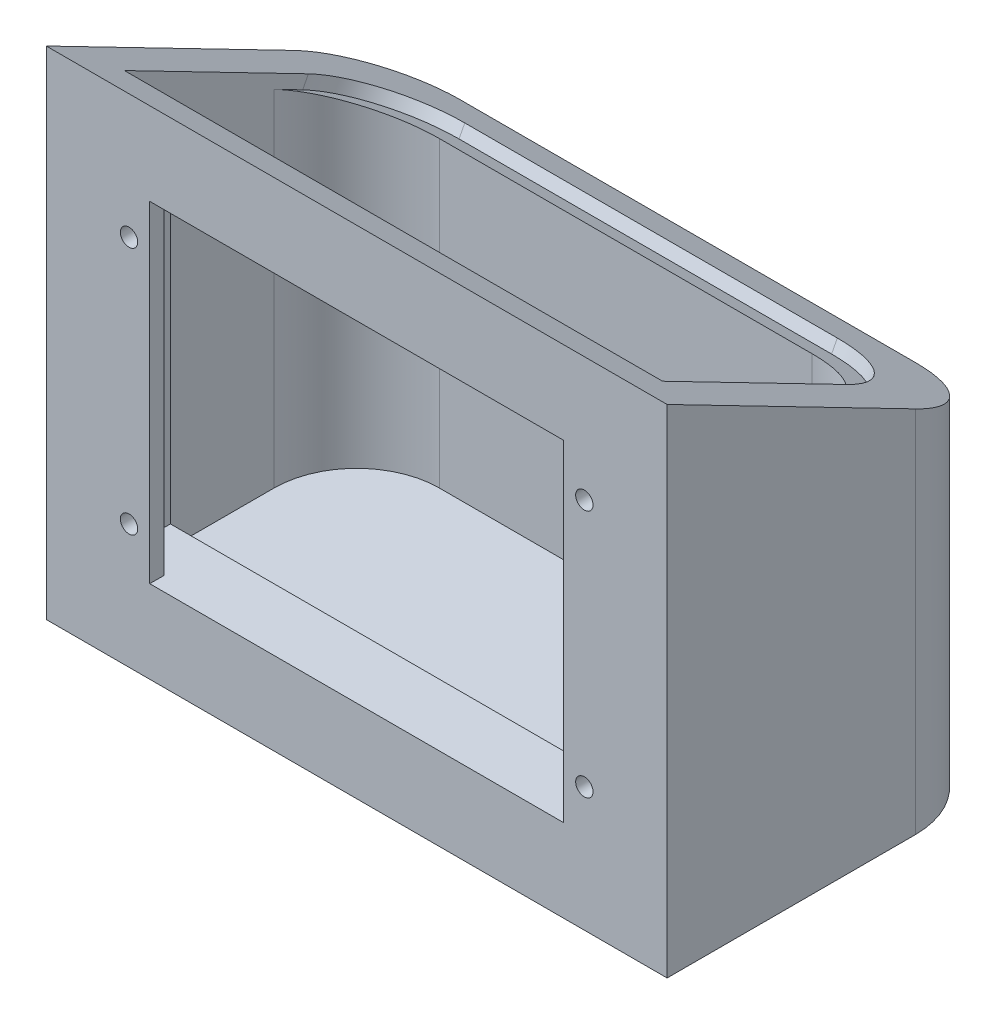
ISO-10303-21;
HEADER;
FILE_DESCRIPTION(('STEP AP214'),'2;1');
FILE_NAME('part.step','',(''),(''),'','','');
FILE_SCHEMA(('AUTOMOTIVE_DESIGN { 1 0 10303 214 1 1 1 1 }'));
ENDSEC;
DATA;
#1=APPLICATION_CONTEXT('core data for automotive mechanical design processes');
#2=APPLICATION_PROTOCOL_DEFINITION('international standard','automotive_design',2000,#1);
#3=PRODUCT_CONTEXT('',#1,'mechanical');
#4=PRODUCT('Part','Part','',(#3));
#5=PRODUCT_RELATED_PRODUCT_CATEGORY('part','',(#4));
#6=PRODUCT_DEFINITION_FORMATION('','',#4);
#7=PRODUCT_DEFINITION_CONTEXT('part definition',#1,'design');
#8=PRODUCT_DEFINITION('design','',#6,#7);
#9=PRODUCT_DEFINITION_SHAPE('','',#8);
#10=(LENGTH_UNIT() NAMED_UNIT(*) SI_UNIT(.MILLI.,.METRE.));
#11=(NAMED_UNIT(*) PLANE_ANGLE_UNIT() SI_UNIT($,.RADIAN.));
#12=(NAMED_UNIT(*) SI_UNIT($,.STERADIAN.) SOLID_ANGLE_UNIT());
#13=UNCERTAINTY_MEASURE_WITH_UNIT(LENGTH_MEASURE(1.E-05),#10,'distance_accuracy_value','');
#14=(GEOMETRIC_REPRESENTATION_CONTEXT(3) GLOBAL_UNCERTAINTY_ASSIGNED_CONTEXT((#13)) GLOBAL_UNIT_ASSIGNED_CONTEXT((#10,
#11,#12)) REPRESENTATION_CONTEXT('',''));
#15=CARTESIAN_POINT('',(0.,0.,0.));
#16=DIRECTION('',(0.,0.,1.));
#17=DIRECTION('',(1.,0.,0.));
#18=AXIS2_PLACEMENT_3D('',#15,#16,#17);
#19=CARTESIAN_POINT('',(15.,100.,-159.22205101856));
#20=DIRECTION('',(0.,1.,0.));
#21=DIRECTION('',(0.,0.,1.));
#22=AXIS2_PLACEMENT_3D('',#19,#20,#21);
#23=PLANE('',#22);
#24=DIRECTION('',(1.,0.,0.));
#25=VECTOR('',#24,1.);
#26=CARTESIAN_POINT('',(125.,100.,-3.5));
#27=LINE('',#26,#25);
#28=CARTESIAN_POINT('',(125.,100.,-3.5));
#29=VERTEX_POINT('',#28);
#30=CARTESIAN_POINT('',(135.,100.,-3.5));
#31=VERTEX_POINT('',#30);
#32=EDGE_CURVE('E60',#29,#31,#27,.T.);
#33=ORIENTED_EDGE('',*,*,#32,.F.);
#34=DIRECTION('',(0.,0.,-1.));
#35=VECTOR('',#34,1.);
#36=CARTESIAN_POINT('',(125.,100.,0.));
#37=LINE('',#36,#35);
#38=CARTESIAN_POINT('',(125.,100.,0.));
#39=VERTEX_POINT('',#38);
#40=EDGE_CURVE('E64',#39,#29,#37,.T.);
#41=ORIENTED_EDGE('',*,*,#40,.F.);
#42=DIRECTION('',(-1.,0.,0.));
#43=VECTOR('',#42,1.);
#44=CARTESIAN_POINT('',(15.,100.,0.));
#45=LINE('',#44,#43);
#46=CARTESIAN_POINT('',(25.,100.,0.));
#47=VERTEX_POINT('',#46);
#48=EDGE_CURVE('E228',#39,#47,#45,.T.);
#49=ORIENTED_EDGE('',*,*,#48,.T.);
#50=DIRECTION('',(0.,0.,-1.));
#51=VECTOR('',#50,1.);
#52=CARTESIAN_POINT('',(25.,100.,0.));
#53=LINE('',#52,#51);
#54=CARTESIAN_POINT('',(25.,100.,-3.5));
#55=VERTEX_POINT('',#54);
#56=EDGE_CURVE('E262',#47,#55,#53,.T.);
#57=ORIENTED_EDGE('',*,*,#56,.T.);
#58=DIRECTION('',(-1.,0.,0.));
#59=VECTOR('',#58,1.);
#60=CARTESIAN_POINT('',(25.,100.,-3.5));
#61=LINE('',#60,#59);
#62=CARTESIAN_POINT('',(15.,100.,-3.5));
#63=VERTEX_POINT('',#62);
#64=EDGE_CURVE('E274',#55,#63,#61,.T.);
#65=ORIENTED_EDGE('',*,*,#64,.T.);
#66=DIRECTION('',(0.,0.,1.));
#67=VECTOR('',#66,1.);
#68=CARTESIAN_POINT('',(15.,100.,-159.22205101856));
#69=LINE('',#68,#67);
#70=CARTESIAN_POINT('',(15.,100.,-15.));
#71=VERTEX_POINT('',#70);
#72=EDGE_CURVE('E287',#71,#63,#69,.T.);
#73=ORIENTED_EDGE('',*,*,#72,.F.);
#74=DIRECTION('',(1.,0.,0.));
#75=VECTOR('',#74,1.);
#76=CARTESIAN_POINT('',(15.,100.,-15.));
#77=LINE('',#76,#75);
#78=CARTESIAN_POINT('',(135.,100.,-15.));
#79=VERTEX_POINT('',#78);
#80=EDGE_CURVE('E286',#71,#79,#77,.T.);
#81=ORIENTED_EDGE('',*,*,#80,.T.);
#82=DIRECTION('',(0.,0.,1.));
#83=VECTOR('',#82,1.);
#84=CARTESIAN_POINT('',(135.,100.,-159.22205101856));
#85=LINE('',#84,#83);
#86=EDGE_CURVE('E300',#79,#31,#85,.T.);
#87=ORIENTED_EDGE('',*,*,#86,.T.);
#88=EDGE_LOOP('',(#33,#41,#49,#57,#65,#73,#81,#87));
#89=FACE_BOUND('',#88,.T.);
#90=ADVANCED_FACE('F44',(#89),#23,.F.);
#91=CARTESIAN_POINT('',(135.,20.,-159.22205101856));
#92=DIRECTION('',(1.,0.,0.));
#93=DIRECTION('',(0.,0.,-1.));
#94=AXIS2_PLACEMENT_3D('',#91,#92,#93);
#95=PLANE('',#94);
#96=DIRECTION('',(0.,-1.,0.));
#97=VECTOR('',#96,1.);
#98=CARTESIAN_POINT('',(135.,100.,-3.5));
#99=LINE('',#98,#97);
#100=CARTESIAN_POINT('',(135.,20.,-3.5));
#101=VERTEX_POINT('',#100);
#102=EDGE_CURVE('E244',#31,#101,#99,.T.);
#103=ORIENTED_EDGE('',*,*,#102,.F.);
#104=ORIENTED_EDGE('',*,*,#86,.F.);
#105=DIRECTION('',(0.,-1.,0.));
#106=VECTOR('',#105,1.);
#107=CARTESIAN_POINT('',(135.,20.,-15.));
#108=LINE('',#107,#106);
#109=CARTESIAN_POINT('',(135.,20.,-15.));
#110=VERTEX_POINT('',#109);
#111=EDGE_CURVE('E282',#79,#110,#108,.T.);
#112=ORIENTED_EDGE('',*,*,#111,.T.);
#113=DIRECTION('',(0.,0.,1.));
#114=VECTOR('',#113,1.);
#115=CARTESIAN_POINT('',(135.,20.,-159.22205101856));
#116=LINE('',#115,#114);
#117=EDGE_CURVE('E303',#110,#101,#116,.T.);
#118=ORIENTED_EDGE('',*,*,#117,.T.);
#119=EDGE_LOOP('',(#103,#104,#112,#118));
#120=FACE_BOUND('',#119,.T.);
#121=ADVANCED_FACE('F534',(#120),#95,.F.);
#122=CARTESIAN_POINT('',(15.,20.,-159.22205101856));
#123=DIRECTION('',(0.,-1.,0.));
#124=DIRECTION('',(0.,0.,-1.));
#125=AXIS2_PLACEMENT_3D('',#122,#123,#124);
#126=PLANE('',#125);
#127=DIRECTION('',(1.,0.,0.));
#128=VECTOR('',#127,1.);
#129=CARTESIAN_POINT('',(125.,20.,-3.49999999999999));
#130=LINE('',#129,#128);
#131=CARTESIAN_POINT('',(125.,20.,-3.5));
#132=VERTEX_POINT('',#131);
#133=EDGE_CURVE('E239',#132,#101,#130,.T.);
#134=ORIENTED_EDGE('',*,*,#133,.T.);
#135=ORIENTED_EDGE('',*,*,#117,.F.);
#136=DIRECTION('',(-1.,0.,0.));
#137=VECTOR('',#136,1.);
#138=CARTESIAN_POINT('',(15.,20.,-15.));
#139=LINE('',#138,#137);
#140=CARTESIAN_POINT('',(15.,20.,-15.));
#141=VERTEX_POINT('',#140);
#142=EDGE_CURVE('E292',#110,#141,#139,.T.);
#143=ORIENTED_EDGE('',*,*,#142,.T.);
#144=DIRECTION('',(0.,0.,1.));
#145=VECTOR('',#144,1.);
#146=CARTESIAN_POINT('',(15.,20.,-159.22205101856));
#147=LINE('',#146,#145);
#148=CARTESIAN_POINT('',(15.,20.,-3.5));
#149=VERTEX_POINT('',#148);
#150=EDGE_CURVE('E296',#141,#149,#147,.T.);
#151=ORIENTED_EDGE('',*,*,#150,.T.);
#152=DIRECTION('',(-1.,0.,0.));
#153=VECTOR('',#152,1.);
#154=CARTESIAN_POINT('',(25.,20.,-3.50000000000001));
#155=LINE('',#154,#153);
#156=CARTESIAN_POINT('',(25.,20.,-3.50000000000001));
#157=VERTEX_POINT('',#156);
#158=EDGE_CURVE('E229',#157,#149,#155,.T.);
#159=ORIENTED_EDGE('',*,*,#158,.F.);
#160=DIRECTION('',(0.,0.,-1.));
#161=VECTOR('',#160,1.);
#162=CARTESIAN_POINT('',(25.,20.,0.));
#163=LINE('',#162,#161);
#164=CARTESIAN_POINT('',(25.,20.,0.));
#165=VERTEX_POINT('',#164);
#166=EDGE_CURVE('E222',#165,#157,#163,.T.);
#167=ORIENTED_EDGE('',*,*,#166,.F.);
#168=DIRECTION('',(1.,0.,0.));
#169=VECTOR('',#168,1.);
#170=CARTESIAN_POINT('',(15.,20.,0.));
#171=LINE('',#170,#169);
#172=CARTESIAN_POINT('',(125.,20.,0.));
#173=VERTEX_POINT('',#172);
#174=EDGE_CURVE('E216',#165,#173,#171,.T.);
#175=ORIENTED_EDGE('',*,*,#174,.T.);
#176=DIRECTION('',(0.,0.,1.));
#177=VECTOR('',#176,1.);
#178=CARTESIAN_POINT('',(125.,20.,0.));
#179=LINE('',#178,#177);
#180=EDGE_CURVE('E219',#132,#173,#179,.T.);
#181=ORIENTED_EDGE('',*,*,#180,.F.);
#182=EDGE_LOOP('',(#134,#135,#143,#151,#159,#167,#175,#181));
#183=FACE_BOUND('',#182,.T.);
#184=ADVANCED_FACE('F218',(#183),#126,.F.);
#185=CARTESIAN_POINT('',(30.,89.8459624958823,-51.9589647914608));
#186=DIRECTION('',(0.,0.888888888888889,-0.458122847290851));
#187=DIRECTION('',(0.,0.458122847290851,0.888888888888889));
#188=AXIS2_PLACEMENT_3D('',#185,#186,#187);
#189=PLANE('',#188);
#190=CARTESIAN_POINT('',(30.,93.4325308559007,-45.));
#191=DIRECTION('',(0.,0.888888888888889,-0.458122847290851));
#192=DIRECTION('',(0.,-0.458122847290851,-0.888888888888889));
#193=AXIS2_PLACEMENT_3D('',#190,#191,#192);
#194=ELLIPSE('',#193,22.5,20.);
#195=CARTESIAN_POINT('',(9.99999999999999,93.4325308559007,-45.));
#196=VERTEX_POINT('',#195);
#197=CARTESIAN_POINT('',(30.,83.1247667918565,-65.));
#198=VERTEX_POINT('',#197);
#199=EDGE_CURVE('E354',#196,#198,#194,.F.);
#200=ORIENTED_EDGE('',*,*,#199,.T.);
#201=DIRECTION('',(1.,0.,0.));
#202=VECTOR('',#201,1.);
#203=CARTESIAN_POINT('',(30.,83.1247667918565,-65.));
#204=LINE('',#203,#202);
#205=CARTESIAN_POINT('',(120.,83.1247667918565,-65.));
#206=VERTEX_POINT('',#205);
#207=EDGE_CURVE('E349',#198,#206,#204,.T.);
#208=ORIENTED_EDGE('',*,*,#207,.T.);
#209=CARTESIAN_POINT('',(120.,93.4325308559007,-45.));
#210=DIRECTION('',(0.,0.888888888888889,-0.458122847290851));
#211=DIRECTION('',(0.,-0.458122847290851,-0.888888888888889));
#212=AXIS2_PLACEMENT_3D('',#209,#210,#211);
#213=ELLIPSE('',#212,22.5,20.);
#214=CARTESIAN_POINT('',(140.,93.4325308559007,-45.));
#215=VERTEX_POINT('',#214);
#216=EDGE_CURVE('E343',#206,#215,#213,.F.);
#217=ORIENTED_EDGE('',*,*,#216,.T.);
#218=DIRECTION('',(0.,-0.458122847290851,-0.888888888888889));
#219=VECTOR('',#218,1.);
#220=CARTESIAN_POINT('',(140.,89.8459624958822,-51.9589647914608));
#221=LINE('',#220,#219);
#222=CARTESIAN_POINT('',(140.,89.8459624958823,-51.9589647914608));
#223=VERTEX_POINT('',#222);
#224=EDGE_CURVE('E376',#215,#223,#221,.T.);
#225=ORIENTED_EDGE('',*,*,#224,.T.);
#226=CARTESIAN_POINT('',(120.,89.8459624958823,-51.9589647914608));
#227=DIRECTION('',(0.,0.888888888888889,-0.458122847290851));
#228=DIRECTION('',(0.,-0.458122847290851,-0.888888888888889));
#229=AXIS2_PLACEMENT_3D('',#226,#227,#228);
#230=CIRCLE('',#229,20.);
#231=CARTESIAN_POINT('',(120.,80.6835055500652,-69.7367425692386));
#232=VERTEX_POINT('',#231);
#233=EDGE_CURVE('E375',#223,#232,#230,.T.);
#234=ORIENTED_EDGE('',*,*,#233,.T.);
#235=DIRECTION('',(-1.,0.,0.));
#236=VECTOR('',#235,1.);
#237=CARTESIAN_POINT('',(30.,80.6835055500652,-69.7367425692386));
#238=LINE('',#237,#236);
#239=CARTESIAN_POINT('',(30.,80.6835055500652,-69.7367425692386));
#240=VERTEX_POINT('',#239);
#241=EDGE_CURVE('E380',#232,#240,#238,.T.);
#242=ORIENTED_EDGE('',*,*,#241,.T.);
#243=CARTESIAN_POINT('',(30.,89.8459624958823,-51.9589647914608));
#244=DIRECTION('',(0.,0.888888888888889,-0.458122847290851));
#245=DIRECTION('',(0.,0.458122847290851,0.888888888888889));
#246=AXIS2_PLACEMENT_3D('',#243,#244,#245);
#247=CIRCLE('',#246,20.);
#248=CARTESIAN_POINT('',(10.,89.8459624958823,-51.9589647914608));
#249=VERTEX_POINT('',#248);
#250=EDGE_CURVE('E384',#240,#249,#247,.T.);
#251=ORIENTED_EDGE('',*,*,#250,.T.);
#252=DIRECTION('',(0.,0.458122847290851,0.888888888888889));
#253=VECTOR('',#252,1.);
#254=CARTESIAN_POINT('',(10.,89.8459624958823,-51.9589647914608));
#255=LINE('',#254,#253);
#256=EDGE_CURVE('E389',#249,#196,#255,.T.);
#257=ORIENTED_EDGE('',*,*,#256,.T.);
#258=EDGE_LOOP('',(#200,#208,#217,#225,#234,#242,#251,#257));
#259=FACE_BOUND('',#258,.T.);
#260=ADVANCED_FACE('F548',(#259),#189,.T.);
#261=CARTESIAN_POINT('',(150.,0.,-80.));
#262=DIRECTION('',(0.,1.,0.));
#263=DIRECTION('',(0.,0.,1.));
#264=AXIS2_PLACEMENT_3D('',#261,#262,#263);
#265=PLANE('',#264);
#266=DIRECTION('',(0.,0.,-1.));
#267=VECTOR('',#266,1.);
#268=CARTESIAN_POINT('',(0.,0.,-80.));
#269=LINE('',#268,#267);
#270=CARTESIAN_POINT('',(0.,0.,0.));
#271=VERTEX_POINT('',#270);
#272=CARTESIAN_POINT('',(0.,0.,-60.));
#273=VERTEX_POINT('',#272);
#274=EDGE_CURVE('E423',#271,#273,#269,.T.);
#275=ORIENTED_EDGE('',*,*,#274,.T.);
#276=CARTESIAN_POINT('',(20.,0.,-60.));
#277=DIRECTION('',(0.,1.,0.));
#278=DIRECTION('',(0.,0.,1.));
#279=AXIS2_PLACEMENT_3D('',#276,#277,#278);
#280=CIRCLE('',#279,20.);
#281=CARTESIAN_POINT('',(20.,0.,-80.));
#282=VERTEX_POINT('',#281);
#283=EDGE_CURVE('E53',#273,#282,#280,.F.);
#284=ORIENTED_EDGE('',*,*,#283,.T.);
#285=DIRECTION('',(-1.,0.,0.));
#286=VECTOR('',#285,1.);
#287=CARTESIAN_POINT('',(150.,0.,-80.));
#288=LINE('',#287,#286);
#289=CARTESIAN_POINT('',(130.,0.,-80.));
#290=VERTEX_POINT('',#289);
#291=EDGE_CURVE('E470',#290,#282,#288,.T.);
#292=ORIENTED_EDGE('',*,*,#291,.F.);
#293=CARTESIAN_POINT('',(130.,0.,-60.));
#294=DIRECTION('',(0.,1.,0.));
#295=DIRECTION('',(0.,0.,1.));
#296=AXIS2_PLACEMENT_3D('',#293,#294,#295);
#297=CIRCLE('',#296,20.);
#298=CARTESIAN_POINT('',(150.,0.,-60.));
#299=VERTEX_POINT('',#298);
#300=EDGE_CURVE('E490',#290,#299,#297,.F.);
#301=ORIENTED_EDGE('',*,*,#300,.T.);
#302=DIRECTION('',(0.,0.,-1.));
#303=VECTOR('',#302,1.);
#304=CARTESIAN_POINT('',(150.,0.,-80.));
#305=LINE('',#304,#303);
#306=CARTESIAN_POINT('',(150.,0.,0.));
#307=VERTEX_POINT('',#306);
#308=EDGE_CURVE('E439',#307,#299,#305,.T.);
#309=ORIENTED_EDGE('',*,*,#308,.F.);
#310=DIRECTION('',(-1.,0.,0.));
#311=VECTOR('',#310,1.);
#312=CARTESIAN_POINT('',(150.,0.,0.));
#313=LINE('',#312,#311);
#314=EDGE_CURVE('E450',#307,#271,#313,.T.);
#315=ORIENTED_EDGE('',*,*,#314,.T.);
#316=EDGE_LOOP('',(#275,#284,#292,#301,#309,#315));
#317=FACE_BOUND('',#316,.T.);
#318=ADVANCED_FACE('F496',(#317),#265,.F.);
#319=CARTESIAN_POINT('',(150.,78.7689437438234,-80.));
#320=DIRECTION('',(0.,0.,1.));
#321=DIRECTION('',(0.,-1.,0.));
#322=AXIS2_PLACEMENT_3D('',#319,#320,#321);
#323=PLANE('',#322);
#324=ORIENTED_EDGE('',*,*,#291,.T.);
#325=DIRECTION('',(0.,1.,0.));
#326=VECTOR('',#325,1.);
#327=CARTESIAN_POINT('',(20.,78.7689437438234,-80.));
#328=LINE('',#327,#326);
#329=CARTESIAN_POINT('',(20.,78.7689437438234,-80.));
#330=VERTEX_POINT('',#329);
#331=EDGE_CURVE('E477',#282,#330,#328,.T.);
#332=ORIENTED_EDGE('',*,*,#331,.T.);
#333=DIRECTION('',(-1.,0.,0.));
#334=VECTOR('',#333,1.);
#335=CARTESIAN_POINT('',(150.,78.7689437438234,-80.));
#336=LINE('',#335,#334);
#337=CARTESIAN_POINT('',(130.,78.7689437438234,-80.));
#338=VERTEX_POINT('',#337);
#339=EDGE_CURVE('E466',#338,#330,#336,.T.);
#340=ORIENTED_EDGE('',*,*,#339,.F.);
#341=DIRECTION('',(0.,1.,0.));
#342=VECTOR('',#341,1.);
#343=CARTESIAN_POINT('',(130.,78.7689437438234,-80.));
#344=LINE('',#343,#342);
#345=EDGE_CURVE('E474',#338,#290,#344,.F.);
#346=ORIENTED_EDGE('',*,*,#345,.T.);
#347=EDGE_LOOP('',(#324,#332,#340,#346));
#348=FACE_BOUND('',#347,.T.);
#349=ADVANCED_FACE('F503',(#348),#323,.F.);
#350=CARTESIAN_POINT('',(150.,120.,0.));
#351=DIRECTION('',(0.,-0.888888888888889,0.458122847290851));
#352=DIRECTION('',(0.,-0.458122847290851,-0.888888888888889));
#353=AXIS2_PLACEMENT_3D('',#350,#351,#352);
#354=PLANE('',#353);
#355=CARTESIAN_POINT('',(120.,92.5126291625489,-53.3333333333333));
#356=DIRECTION('',(0.,0.888888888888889,-0.458122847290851));
#357=DIRECTION('',(0.,-0.458122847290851,-0.888888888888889));
#358=AXIS2_PLACEMENT_3D('',#355,#356,#357);
#359=CIRCLE('',#358,20.);
#360=CARTESIAN_POINT('',(140.,92.5126291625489,-53.3333333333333));
#361=VERTEX_POINT('',#360);
#362=CARTESIAN_POINT('',(120.,83.3501722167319,-71.1111111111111));
#363=VERTEX_POINT('',#362);
#364=EDGE_CURVE('E400',#361,#363,#359,.T.);
#365=ORIENTED_EDGE('',*,*,#364,.F.);
#366=DIRECTION('',(0.,-0.458122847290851,-0.888888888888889));
#367=VECTOR('',#366,1.);
#368=CARTESIAN_POINT('',(140.,92.5126291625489,-53.3333333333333));
#369=LINE('',#368,#367);
#370=CARTESIAN_POINT('',(140.,115.418771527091,-8.88888888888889));
#371=VERTEX_POINT('',#370);
#372=EDGE_CURVE('E370',#371,#361,#369,.T.);
#373=ORIENTED_EDGE('',*,*,#372,.F.);
#374=DIRECTION('',(1.,0.,0.));
#375=VECTOR('',#374,1.);
#376=CARTESIAN_POINT('',(10.,115.418771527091,-8.88888888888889));
#377=LINE('',#376,#375);
#378=CARTESIAN_POINT('',(10.,115.418771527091,-8.88888888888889));
#379=VERTEX_POINT('',#378);
#380=EDGE_CURVE('E416',#379,#371,#377,.T.);
#381=ORIENTED_EDGE('',*,*,#380,.F.);
#382=DIRECTION('',(0.,0.458122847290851,0.888888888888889));
#383=VECTOR('',#382,1.);
#384=CARTESIAN_POINT('',(10.,92.5126291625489,-53.3333333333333));
#385=LINE('',#384,#383);
#386=CARTESIAN_POINT('',(10.,92.5126291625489,-53.3333333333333));
#387=VERTEX_POINT('',#386);
#388=EDGE_CURVE('E412',#387,#379,#385,.T.);
#389=ORIENTED_EDGE('',*,*,#388,.F.);
#390=CARTESIAN_POINT('',(30.,92.5126291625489,-53.3333333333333));
#391=DIRECTION('',(0.,0.888888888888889,-0.458122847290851));
#392=DIRECTION('',(0.,0.458122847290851,0.888888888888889));
#393=AXIS2_PLACEMENT_3D('',#390,#391,#392);
#394=CIRCLE('',#393,20.);
#395=CARTESIAN_POINT('',(30.,83.3501722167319,-71.1111111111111));
#396=VERTEX_POINT('',#395);
#397=EDGE_CURVE('E408',#396,#387,#394,.T.);
#398=ORIENTED_EDGE('',*,*,#397,.F.);
#399=DIRECTION('',(-1.,0.,0.));
#400=VECTOR('',#399,1.);
#401=CARTESIAN_POINT('',(30.,83.3501722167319,-71.1111111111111));
#402=LINE('',#401,#400);
#403=EDGE_CURVE('E404',#363,#396,#402,.T.);
#404=ORIENTED_EDGE('',*,*,#403,.F.);
#405=EDGE_LOOP('',(#365,#373,#381,#389,#398,#404));
#406=FACE_BOUND('',#405,.T.);
#407=ORIENTED_EDGE('',*,*,#339,.T.);
#408=CARTESIAN_POINT('',(20.,89.0767078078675,-60.));
#409=DIRECTION('',(0.,-0.888888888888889,0.458122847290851));
#410=DIRECTION('',(0.,-0.458122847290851,-0.888888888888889));
#411=AXIS2_PLACEMENT_3D('',#408,#409,#410);
#412=ELLIPSE('',#411,22.5,20.);
#413=CARTESIAN_POINT('',(0.,89.0767078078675,-60.));
#414=VERTEX_POINT('',#413);
#415=EDGE_CURVE('E484',#330,#414,#412,.F.);
#416=ORIENTED_EDGE('',*,*,#415,.T.);
#417=DIRECTION('',(0.,0.458122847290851,0.888888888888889));
#418=VECTOR('',#417,1.);
#419=CARTESIAN_POINT('',(0.,120.,0.));
#420=LINE('',#419,#418);
#421=CARTESIAN_POINT('',(0.,120.,0.));
#422=VERTEX_POINT('',#421);
#423=EDGE_CURVE('E454',#414,#422,#420,.T.);
#424=ORIENTED_EDGE('',*,*,#423,.T.);
#425=DIRECTION('',(-1.,0.,0.));
#426=VECTOR('',#425,1.);
#427=CARTESIAN_POINT('',(150.,120.,0.));
#428=LINE('',#427,#426);
#429=CARTESIAN_POINT('',(150.,120.,0.));
#430=VERTEX_POINT('',#429);
#431=EDGE_CURVE('E462',#430,#422,#428,.T.);
#432=ORIENTED_EDGE('',*,*,#431,.F.);
#433=DIRECTION('',(0.,0.458122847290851,0.888888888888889));
#434=VECTOR('',#433,1.);
#435=CARTESIAN_POINT('',(150.,120.,0.));
#436=LINE('',#435,#434);
#437=CARTESIAN_POINT('',(150.,89.0767078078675,-60.));
#438=VERTEX_POINT('',#437);
#439=EDGE_CURVE('E443',#438,#430,#436,.T.);
#440=ORIENTED_EDGE('',*,*,#439,.F.);
#441=CARTESIAN_POINT('',(130.,89.0767078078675,-60.));
#442=DIRECTION('',(0.,-0.888888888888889,0.458122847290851));
#443=DIRECTION('',(0.,0.458122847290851,0.888888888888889));
#444=AXIS2_PLACEMENT_3D('',#441,#442,#443);
#445=ELLIPSE('',#444,22.5,20.);
#446=EDGE_CURVE('E481',#438,#338,#445,.F.);
#447=ORIENTED_EDGE('',*,*,#446,.T.);
#448=EDGE_LOOP('',(#407,#416,#424,#432,#440,#447));
#449=FACE_BOUND('',#448,.T.);
#450=ADVANCED_FACE('F509',(#406,#449),#354,.F.);
#451=CARTESIAN_POINT('',(150.,0.,0.));
#452=DIRECTION('',(0.,0.,-1.));
#453=DIRECTION('',(-1.,0.,0.));
#454=AXIS2_PLACEMENT_3D('',#451,#452,#453);
#455=PLANE('',#454);
#456=CARTESIAN_POINT('',(20.,90.,0.));
#457=DIRECTION('',(0.,0.,1.));
#458=DIRECTION('',(-1.,0.,0.));
#459=AXIS2_PLACEMENT_3D('',#456,#457,#458);
#460=CIRCLE('',#459,2.09999999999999);
#461=CARTESIAN_POINT('',(17.9,90.,0.));
#462=VERTEX_POINT('',#461);
#463=EDGE_CURVE('E788',#462,#462,#460,.T.);
#464=ORIENTED_EDGE('',*,*,#463,.F.);
#465=EDGE_LOOP('',(#464));
#466=FACE_BOUND('',#465,.T.);
#467=CARTESIAN_POINT('',(20.,30.,0.));
#468=DIRECTION('',(0.,0.,1.));
#469=DIRECTION('',(-1.,0.,0.));
#470=AXIS2_PLACEMENT_3D('',#467,#468,#469);
#471=CIRCLE('',#470,2.09999999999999);
#472=CARTESIAN_POINT('',(17.9,30.,0.));
#473=VERTEX_POINT('',#472);
#474=EDGE_CURVE('E799',#473,#473,#471,.T.);
#475=ORIENTED_EDGE('',*,*,#474,.F.);
#476=EDGE_LOOP('',(#475));
#477=FACE_BOUND('',#476,.T.);
#478=CARTESIAN_POINT('',(130.,30.,0.));
#479=DIRECTION('',(0.,0.,1.));
#480=DIRECTION('',(1.,0.,0.));
#481=AXIS2_PLACEMENT_3D('',#478,#479,#480);
#482=CIRCLE('',#481,2.09999999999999);
#483=CARTESIAN_POINT('',(132.1,30.,0.));
#484=VERTEX_POINT('',#483);
#485=EDGE_CURVE('E804',#484,#484,#482,.T.);
#486=ORIENTED_EDGE('',*,*,#485,.F.);
#487=EDGE_LOOP('',(#486));
#488=FACE_BOUND('',#487,.T.);
#489=CARTESIAN_POINT('',(130.,90.,0.));
#490=DIRECTION('',(0.,0.,1.));
#491=DIRECTION('',(1.,0.,0.));
#492=AXIS2_PLACEMENT_3D('',#489,#490,#491);
#493=CIRCLE('',#492,2.09999999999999);
#494=CARTESIAN_POINT('',(132.1,90.,0.));
#495=VERTEX_POINT('',#494);
#496=EDGE_CURVE('E801',#495,#495,#493,.T.);
#497=ORIENTED_EDGE('',*,*,#496,.F.);
#498=EDGE_LOOP('',(#497));
#499=FACE_BOUND('',#498,.T.);
#500=ORIENTED_EDGE('',*,*,#48,.F.);
#501=DIRECTION('',(0.,1.,0.));
#502=VECTOR('',#501,1.);
#503=CARTESIAN_POINT('',(125.,100.,0.));
#504=LINE('',#503,#502);
#505=EDGE_CURVE('E234',#173,#39,#504,.T.);
#506=ORIENTED_EDGE('',*,*,#505,.F.);
#507=ORIENTED_EDGE('',*,*,#174,.F.);
#508=DIRECTION('',(0.,-1.,0.));
#509=VECTOR('',#508,1.);
#510=CARTESIAN_POINT('',(25.,100.,0.));
#511=LINE('',#510,#509);
#512=EDGE_CURVE('E271',#47,#165,#511,.T.);
#513=ORIENTED_EDGE('',*,*,#512,.F.);
#514=EDGE_LOOP('',(#500,#506,#507,#513));
#515=FACE_BOUND('',#514,.T.);
#516=DIRECTION('',(0.,-1.,0.));
#517=VECTOR('',#516,1.);
#518=CARTESIAN_POINT('',(0.,0.,0.));
#519=LINE('',#518,#517);
#520=EDGE_CURVE('E444',#422,#271,#519,.T.);
#521=ORIENTED_EDGE('',*,*,#520,.T.);
#522=ORIENTED_EDGE('',*,*,#314,.F.);
#523=DIRECTION('',(0.,-1.,0.));
#524=VECTOR('',#523,1.);
#525=CARTESIAN_POINT('',(150.,0.,0.));
#526=LINE('',#525,#524);
#527=EDGE_CURVE('E447',#430,#307,#526,.T.);
#528=ORIENTED_EDGE('',*,*,#527,.F.);
#529=ORIENTED_EDGE('',*,*,#431,.T.);
#530=EDGE_LOOP('',(#521,#522,#528,#529));
#531=FACE_BOUND('',#530,.T.);
#532=ADVANCED_FACE('F241',(#466,#477,#488,#499,#515,#531),#455,.F.);
#533=CARTESIAN_POINT('',(150.,0.,0.));
#534=DIRECTION('',(-1.,0.,0.));
#535=DIRECTION('',(0.,0.,1.));
#536=AXIS2_PLACEMENT_3D('',#533,#534,#535);
#537=PLANE('',#536);
#538=ORIENTED_EDGE('',*,*,#308,.T.);
#539=DIRECTION('',(0.,1.,0.));
#540=VECTOR('',#539,1.);
#541=CARTESIAN_POINT('',(150.,0.,-60.));
#542=LINE('',#541,#540);
#543=EDGE_CURVE('E11',#299,#438,#542,.T.);
#544=ORIENTED_EDGE('',*,*,#543,.T.);
#545=ORIENTED_EDGE('',*,*,#439,.T.);
#546=ORIENTED_EDGE('',*,*,#527,.T.);
#547=EDGE_LOOP('',(#538,#544,#545,#546));
#548=FACE_BOUND('',#547,.T.);
#549=ADVANCED_FACE('F519',(#548),#537,.F.);
#550=CARTESIAN_POINT('',(0.,0.,0.));
#551=DIRECTION('',(-1.,0.,0.));
#552=DIRECTION('',(0.,0.,1.));
#553=AXIS2_PLACEMENT_3D('',#550,#551,#552);
#554=PLANE('',#553);
#555=ORIENTED_EDGE('',*,*,#423,.F.);
#556=DIRECTION('',(0.,1.,0.));
#557=VECTOR('',#556,1.);
#558=CARTESIAN_POINT('',(0.,0.,-60.));
#559=LINE('',#558,#557);
#560=EDGE_CURVE('E487',#414,#273,#559,.F.);
#561=ORIENTED_EDGE('',*,*,#560,.T.);
#562=ORIENTED_EDGE('',*,*,#274,.F.);
#563=ORIENTED_EDGE('',*,*,#520,.F.);
#564=EDGE_LOOP('',(#555,#561,#562,#563));
#565=FACE_BOUND('',#564,.T.);
#566=ADVANCED_FACE('F513',(#565),#554,.T.);
#567=CARTESIAN_POINT('',(140.,89.8459624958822,-51.9589647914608));
#568=DIRECTION('',(1.,0.,0.));
#569=DIRECTION('',(0.,0.,-1.));
#570=AXIS2_PLACEMENT_3D('',#567,#568,#569);
#571=PLANE('',#570);
#572=ORIENTED_EDGE('',*,*,#372,.T.);
#573=DIRECTION('',(0.,0.888888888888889,-0.458122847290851));
#574=VECTOR('',#573,1.);
#575=CARTESIAN_POINT('',(140.,89.8459624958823,-51.9589647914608));
#576=LINE('',#575,#574);
#577=EDGE_CURVE('E397',#223,#361,#576,.T.);
#578=ORIENTED_EDGE('',*,*,#577,.F.);
#579=ORIENTED_EDGE('',*,*,#224,.F.);
#580=DIRECTION('',(0.,-1.,0.));
#581=VECTOR('',#580,1.);
#582=CARTESIAN_POINT('',(140.,243.998597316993,-45.));
#583=LINE('',#582,#581);
#584=CARTESIAN_POINT('',(140.,10.,-45.));
#585=VERTEX_POINT('',#584);
#586=EDGE_CURVE('E347',#215,#585,#583,.T.);
#587=ORIENTED_EDGE('',*,*,#586,.T.);
#588=DIRECTION('',(0.,0.,1.));
#589=VECTOR('',#588,1.);
#590=CARTESIAN_POINT('',(140.,10.,-15.));
#591=LINE('',#590,#589);
#592=CARTESIAN_POINT('',(140.,10.,-15.));
#593=VERTEX_POINT('',#592);
#594=EDGE_CURVE('E313',#585,#593,#591,.T.);
#595=ORIENTED_EDGE('',*,*,#594,.T.);
#596=DIRECTION('',(0.,-1.,0.));
#597=VECTOR('',#596,1.);
#598=CARTESIAN_POINT('',(140.,243.998597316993,-15.));
#599=LINE('',#598,#597);
#600=CARTESIAN_POINT('',(140.,108.894176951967,-15.));
#601=VERTEX_POINT('',#600);
#602=EDGE_CURVE('E342',#601,#593,#599,.T.);
#603=ORIENTED_EDGE('',*,*,#602,.F.);
#604=CARTESIAN_POINT('',(140.,112.752104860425,-7.51452034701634));
#605=VERTEX_POINT('',#604);
#606=EDGE_CURVE('E371',#605,#601,#221,.T.);
#607=ORIENTED_EDGE('',*,*,#606,.F.);
#608=DIRECTION('',(0.,0.888888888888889,-0.458122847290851));
#609=VECTOR('',#608,1.);
#610=CARTESIAN_POINT('',(140.,112.752104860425,-7.51452034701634));
#611=LINE('',#610,#609);
#612=EDGE_CURVE('E420',#605,#371,#611,.T.);
#613=ORIENTED_EDGE('',*,*,#612,.T.);
#614=EDGE_LOOP('',(#572,#578,#579,#587,#595,#603,#607,#613));
#615=FACE_BOUND('',#614,.T.);
#616=ADVANCED_FACE('F576',(#615),#571,.F.);
#617=CARTESIAN_POINT('',(10.,112.752104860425,-7.51452034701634));
#618=DIRECTION('',(0.,0.458122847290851,0.888888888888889));
#619=DIRECTION('',(0.,-0.888888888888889,0.458122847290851));
#620=AXIS2_PLACEMENT_3D('',#617,#618,#619);
#621=PLANE('',#620);
#622=ORIENTED_EDGE('',*,*,#380,.T.);
#623=ORIENTED_EDGE('',*,*,#612,.F.);
#624=DIRECTION('',(1.,0.,0.));
#625=VECTOR('',#624,1.);
#626=CARTESIAN_POINT('',(10.,112.752104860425,-7.51452034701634));
#627=LINE('',#626,#625);
#628=CARTESIAN_POINT('',(10.,112.752104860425,-7.51452034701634));
#629=VERTEX_POINT('',#628);
#630=EDGE_CURVE('E393',#629,#605,#627,.T.);
#631=ORIENTED_EDGE('',*,*,#630,.F.);
#632=DIRECTION('',(0.,0.888888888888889,-0.458122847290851));
#633=VECTOR('',#632,1.);
#634=CARTESIAN_POINT('',(10.,112.752104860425,-7.51452034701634));
#635=LINE('',#634,#633);
#636=EDGE_CURVE('E424',#629,#379,#635,.T.);
#637=ORIENTED_EDGE('',*,*,#636,.T.);
#638=EDGE_LOOP('',(#622,#623,#631,#637));
#639=FACE_BOUND('',#638,.T.);
#640=ADVANCED_FACE('F572',(#639),#621,.F.);
#641=CARTESIAN_POINT('',(10.,89.8459624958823,-51.9589647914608));
#642=DIRECTION('',(-1.,0.,0.));
#643=DIRECTION('',(0.,0.,1.));
#644=AXIS2_PLACEMENT_3D('',#641,#642,#643);
#645=PLANE('',#644);
#646=ORIENTED_EDGE('',*,*,#388,.T.);
#647=ORIENTED_EDGE('',*,*,#636,.F.);
#648=CARTESIAN_POINT('',(10.,108.894176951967,-15.));
#649=VERTEX_POINT('',#648);
#650=EDGE_CURVE('E388',#649,#629,#255,.T.);
#651=ORIENTED_EDGE('',*,*,#650,.F.);
#652=DIRECTION('',(0.,-1.,0.));
#653=VECTOR('',#652,1.);
#654=CARTESIAN_POINT('',(9.99999999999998,243.998597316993,-15.));
#655=LINE('',#654,#653);
#656=CARTESIAN_POINT('',(9.99999999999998,10.,-15.));
#657=VERTEX_POINT('',#656);
#658=EDGE_CURVE('E341',#649,#657,#655,.T.);
#659=ORIENTED_EDGE('',*,*,#658,.T.);
#660=DIRECTION('',(0.,0.,-1.));
#661=VECTOR('',#660,1.);
#662=CARTESIAN_POINT('',(9.99999999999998,10.,-15.));
#663=LINE('',#662,#661);
#664=CARTESIAN_POINT('',(9.99999999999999,10.,-45.));
#665=VERTEX_POINT('',#664);
#666=EDGE_CURVE('E330',#657,#665,#663,.T.);
#667=ORIENTED_EDGE('',*,*,#666,.T.);
#668=DIRECTION('',(0.,-1.,0.));
#669=VECTOR('',#668,1.);
#670=CARTESIAN_POINT('',(9.99999999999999,243.998597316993,-45.));
#671=LINE('',#670,#669);
#672=EDGE_CURVE('E317',#196,#665,#671,.T.);
#673=ORIENTED_EDGE('',*,*,#672,.F.);
#674=ORIENTED_EDGE('',*,*,#256,.F.);
#675=DIRECTION('',(0.,0.888888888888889,-0.458122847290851));
#676=VECTOR('',#675,1.);
#677=CARTESIAN_POINT('',(10.,89.8459624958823,-51.9589647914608));
#678=LINE('',#677,#676);
#679=EDGE_CURVE('E427',#249,#387,#678,.T.);
#680=ORIENTED_EDGE('',*,*,#679,.T.);
#681=EDGE_LOOP('',(#646,#647,#651,#659,#667,#673,#674,#680));
#682=FACE_BOUND('',#681,.T.);
#683=ADVANCED_FACE('F575',(#682),#645,.F.);
#684=CARTESIAN_POINT('',(30.,89.8459624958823,-51.9589647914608));
#685=DIRECTION('',(0.,0.888888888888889,-0.458122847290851));
#686=DIRECTION('',(0.,0.458122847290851,0.888888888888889));
#687=AXIS2_PLACEMENT_3D('',#684,#685,#686);
#688=CYLINDRICAL_SURFACE('',#687,20.);
#689=ORIENTED_EDGE('',*,*,#397,.T.);
#690=ORIENTED_EDGE('',*,*,#679,.F.);
#691=ORIENTED_EDGE('',*,*,#250,.F.);
#692=DIRECTION('',(0.,0.888888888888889,-0.458122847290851));
#693=VECTOR('',#692,1.);
#694=CARTESIAN_POINT('',(30.,80.6835055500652,-69.7367425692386));
#695=LINE('',#694,#693);
#696=EDGE_CURVE('E430',#240,#396,#695,.T.);
#697=ORIENTED_EDGE('',*,*,#696,.T.);
#698=EDGE_LOOP('',(#689,#690,#691,#697));
#699=FACE_BOUND('',#698,.T.);
#700=ADVANCED_FACE('F580',(#699),#688,.F.);
#701=CARTESIAN_POINT('',(30.,80.6835055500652,-69.7367425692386));
#702=DIRECTION('',(0.,-0.458122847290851,-0.888888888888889));
#703=DIRECTION('',(0.,0.888888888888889,-0.458122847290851));
#704=AXIS2_PLACEMENT_3D('',#701,#702,#703);
#705=PLANE('',#704);
#706=ORIENTED_EDGE('',*,*,#403,.T.);
#707=ORIENTED_EDGE('',*,*,#696,.F.);
#708=ORIENTED_EDGE('',*,*,#241,.F.);
#709=DIRECTION('',(0.,0.888888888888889,-0.458122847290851));
#710=VECTOR('',#709,1.);
#711=CARTESIAN_POINT('',(120.,80.6835055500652,-69.7367425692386));
#712=LINE('',#711,#710);
#713=EDGE_CURVE('E433',#232,#363,#712,.T.);
#714=ORIENTED_EDGE('',*,*,#713,.T.);
#715=EDGE_LOOP('',(#706,#707,#708,#714));
#716=FACE_BOUND('',#715,.T.);
#717=ADVANCED_FACE('F584',(#716),#705,.F.);
#718=CARTESIAN_POINT('',(120.,89.8459624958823,-51.9589647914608));
#719=DIRECTION('',(0.,0.888888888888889,-0.458122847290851));
#720=DIRECTION('',(0.,0.458122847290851,0.888888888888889));
#721=AXIS2_PLACEMENT_3D('',#718,#719,#720);
#722=CYLINDRICAL_SURFACE('',#721,20.);
#723=ORIENTED_EDGE('',*,*,#364,.T.);
#724=ORIENTED_EDGE('',*,*,#713,.F.);
#725=ORIENTED_EDGE('',*,*,#233,.F.);
#726=ORIENTED_EDGE('',*,*,#577,.T.);
#727=EDGE_LOOP('',(#723,#724,#725,#726));
#728=FACE_BOUND('',#727,.T.);
#729=ADVANCED_FACE('F570',(#728),#722,.F.);
#730=DIRECTION('',(-1.,0.,0.));
#731=VECTOR('',#730,1.);
#732=CARTESIAN_POINT('',(9.99999999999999,108.894176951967,-15.));
#733=LINE('',#732,#731);
#734=EDGE_CURVE('E337',#601,#649,#733,.T.);
#735=ORIENTED_EDGE('',*,*,#734,.T.);
#736=ORIENTED_EDGE('',*,*,#650,.T.);
#737=ORIENTED_EDGE('',*,*,#630,.T.);
#738=ORIENTED_EDGE('',*,*,#606,.T.);
#739=EDGE_LOOP('',(#735,#736,#737,#738));
#740=FACE_BOUND('',#739,.T.);
#741=ADVANCED_FACE('F532',(#740),#189,.T.);
#742=CARTESIAN_POINT('',(20.,78.7689437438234,-60.));
#743=DIRECTION('',(0.,-1.,0.));
#744=DIRECTION('',(0.,0.,-1.));
#745=AXIS2_PLACEMENT_3D('',#742,#743,#744);
#746=CYLINDRICAL_SURFACE('',#745,20.);
#747=ORIENTED_EDGE('',*,*,#283,.F.);
#748=ORIENTED_EDGE('',*,*,#560,.F.);
#749=ORIENTED_EDGE('',*,*,#415,.F.);
#750=ORIENTED_EDGE('',*,*,#331,.F.);
#751=EDGE_LOOP('',(#747,#748,#749,#750));
#752=FACE_BOUND('',#751,.T.);
#753=ADVANCED_FACE('F506',(#752),#746,.T.);
#754=CARTESIAN_POINT('',(130.,0.,-60.));
#755=DIRECTION('',(0.,1.,0.));
#756=DIRECTION('',(0.,0.,1.));
#757=AXIS2_PLACEMENT_3D('',#754,#755,#756);
#758=CYLINDRICAL_SURFACE('',#757,20.);
#759=ORIENTED_EDGE('',*,*,#300,.F.);
#760=ORIENTED_EDGE('',*,*,#345,.F.);
#761=ORIENTED_EDGE('',*,*,#446,.F.);
#762=ORIENTED_EDGE('',*,*,#543,.F.);
#763=EDGE_LOOP('',(#759,#760,#761,#762));
#764=FACE_BOUND('',#763,.T.);
#765=ADVANCED_FACE('F46',(#764),#758,.T.);
#766=CARTESIAN_POINT('',(120.,10.,-45.));
#767=DIRECTION('',(0.,-1.,0.));
#768=DIRECTION('',(0.,0.,-1.));
#769=AXIS2_PLACEMENT_3D('',#766,#767,#768);
#770=PLANE('',#769);
#771=DIRECTION('',(-1.,0.,0.));
#772=VECTOR('',#771,1.);
#773=CARTESIAN_POINT('',(9.99999999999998,10.,-15.));
#774=LINE('',#773,#772);
#775=EDGE_CURVE('E312',#593,#657,#774,.T.);
#776=ORIENTED_EDGE('',*,*,#775,.F.);
#777=ORIENTED_EDGE('',*,*,#594,.F.);
#778=CARTESIAN_POINT('',(120.,10.,-45.));
#779=DIRECTION('',(0.,-1.,0.));
#780=DIRECTION('',(0.,0.,-1.));
#781=AXIS2_PLACEMENT_3D('',#778,#779,#780);
#782=CIRCLE('',#781,20.);
#783=CARTESIAN_POINT('',(120.,10.,-65.));
#784=VERTEX_POINT('',#783);
#785=EDGE_CURVE('E318',#784,#585,#782,.T.);
#786=ORIENTED_EDGE('',*,*,#785,.F.);
#787=DIRECTION('',(1.,0.,0.));
#788=VECTOR('',#787,1.);
#789=CARTESIAN_POINT('',(30.,10.,-65.));
#790=LINE('',#789,#788);
#791=CARTESIAN_POINT('',(30.,10.,-65.));
#792=VERTEX_POINT('',#791);
#793=EDGE_CURVE('E322',#792,#784,#790,.T.);
#794=ORIENTED_EDGE('',*,*,#793,.F.);
#795=CARTESIAN_POINT('',(30.,10.,-45.));
#796=DIRECTION('',(0.,-1.,0.));
#797=DIRECTION('',(0.,0.,1.));
#798=AXIS2_PLACEMENT_3D('',#795,#796,#797);
#799=CIRCLE('',#798,20.);
#800=EDGE_CURVE('E326',#665,#792,#799,.T.);
#801=ORIENTED_EDGE('',*,*,#800,.F.);
#802=ORIENTED_EDGE('',*,*,#666,.F.);
#803=EDGE_LOOP('',(#776,#777,#786,#794,#801,#802));
#804=FACE_BOUND('',#803,.T.);
#805=ADVANCED_FACE('F523',(#804),#770,.F.);
#806=CARTESIAN_POINT('',(30.,243.998597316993,-45.));
#807=DIRECTION('',(0.,-1.,0.));
#808=DIRECTION('',(0.,0.,-1.));
#809=AXIS2_PLACEMENT_3D('',#806,#807,#808);
#810=CYLINDRICAL_SURFACE('',#809,20.);
#811=ORIENTED_EDGE('',*,*,#672,.T.);
#812=ORIENTED_EDGE('',*,*,#800,.T.);
#813=DIRECTION('',(0.,-1.,0.));
#814=VECTOR('',#813,1.);
#815=CARTESIAN_POINT('',(30.,243.998597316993,-65.));
#816=LINE('',#815,#814);
#817=EDGE_CURVE('E353',#198,#792,#816,.T.);
#818=ORIENTED_EDGE('',*,*,#817,.F.);
#819=ORIENTED_EDGE('',*,*,#199,.F.);
#820=EDGE_LOOP('',(#811,#812,#818,#819));
#821=FACE_BOUND('',#820,.T.);
#822=ADVANCED_FACE('F529',(#821),#810,.F.);
#823=CARTESIAN_POINT('',(30.,243.998597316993,-65.));
#824=DIRECTION('',(0.,0.,-1.));
#825=DIRECTION('',(-1.,0.,0.));
#826=AXIS2_PLACEMENT_3D('',#823,#824,#825);
#827=PLANE('',#826);
#828=ORIENTED_EDGE('',*,*,#817,.T.);
#829=ORIENTED_EDGE('',*,*,#793,.T.);
#830=DIRECTION('',(0.,-1.,0.));
#831=VECTOR('',#830,1.);
#832=CARTESIAN_POINT('',(120.,243.998597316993,-65.));
#833=LINE('',#832,#831);
#834=EDGE_CURVE('E348',#206,#784,#833,.T.);
#835=ORIENTED_EDGE('',*,*,#834,.F.);
#836=ORIENTED_EDGE('',*,*,#207,.F.);
#837=EDGE_LOOP('',(#828,#829,#835,#836));
#838=FACE_BOUND('',#837,.T.);
#839=ADVANCED_FACE('F560',(#838),#827,.F.);
#840=CARTESIAN_POINT('',(120.,243.998597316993,-45.));
#841=DIRECTION('',(0.,-1.,0.));
#842=DIRECTION('',(0.,0.,-1.));
#843=AXIS2_PLACEMENT_3D('',#840,#841,#842);
#844=CYLINDRICAL_SURFACE('',#843,20.);
#845=ORIENTED_EDGE('',*,*,#834,.T.);
#846=ORIENTED_EDGE('',*,*,#785,.T.);
#847=ORIENTED_EDGE('',*,*,#586,.F.);
#848=ORIENTED_EDGE('',*,*,#216,.F.);
#849=EDGE_LOOP('',(#845,#846,#847,#848));
#850=FACE_BOUND('',#849,.T.);
#851=ADVANCED_FACE('F556',(#850),#844,.F.);
#852=CARTESIAN_POINT('',(9.99999999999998,243.998597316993,-15.));
#853=DIRECTION('',(0.,0.,1.));
#854=DIRECTION('',(1.,0.,0.));
#855=AXIS2_PLACEMENT_3D('',#852,#853,#854);
#856=PLANE('',#855);
#857=ORIENTED_EDGE('',*,*,#80,.F.);
#858=DIRECTION('',(0.,1.,0.));
#859=VECTOR('',#858,1.);
#860=CARTESIAN_POINT('',(15.,20.,-15.));
#861=LINE('',#860,#859);
#862=EDGE_CURVE('E290',#141,#71,#861,.T.);
#863=ORIENTED_EDGE('',*,*,#862,.F.);
#864=ORIENTED_EDGE('',*,*,#142,.F.);
#865=ORIENTED_EDGE('',*,*,#111,.F.);
#866=EDGE_LOOP('',(#857,#863,#864,#865));
#867=FACE_BOUND('',#866,.T.);
#868=ORIENTED_EDGE('',*,*,#602,.T.);
#869=ORIENTED_EDGE('',*,*,#775,.T.);
#870=ORIENTED_EDGE('',*,*,#658,.F.);
#871=ORIENTED_EDGE('',*,*,#734,.F.);
#872=EDGE_LOOP('',(#868,#869,#870,#871));
#873=FACE_BOUND('',#872,.T.);
#874=ADVANCED_FACE('F551',(#867,#873),#856,.F.);
#875=CARTESIAN_POINT('',(15.,20.,-159.22205101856));
#876=DIRECTION('',(-1.,0.,0.));
#877=DIRECTION('',(0.,0.,1.));
#878=AXIS2_PLACEMENT_3D('',#875,#876,#877);
#879=PLANE('',#878);
#880=ORIENTED_EDGE('',*,*,#72,.T.);
#881=DIRECTION('',(0.,-1.,0.));
#882=VECTOR('',#881,1.);
#883=CARTESIAN_POINT('',(15.,100.,-3.5));
#884=LINE('',#883,#882);
#885=EDGE_CURVE('E261',#63,#149,#884,.T.);
#886=ORIENTED_EDGE('',*,*,#885,.T.);
#887=ORIENTED_EDGE('',*,*,#150,.F.);
#888=ORIENTED_EDGE('',*,*,#862,.T.);
#889=EDGE_LOOP('',(#880,#886,#887,#888));
#890=FACE_BOUND('',#889,.T.);
#891=ADVANCED_FACE('F549',(#890),#879,.F.);
#892=CARTESIAN_POINT('',(25.,100.,-3.5));
#893=DIRECTION('',(0.,0.,-1.));
#894=DIRECTION('',(0.,1.,0.));
#895=AXIS2_PLACEMENT_3D('',#892,#893,#894);
#896=PLANE('',#895);
#897=CARTESIAN_POINT('',(20.,90.,-3.5));
#898=DIRECTION('',(0.,0.,-1.));
#899=DIRECTION('',(0.,1.,0.));
#900=AXIS2_PLACEMENT_3D('',#897,#898,#899);
#901=CIRCLE('',#900,2.09999999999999);
#902=CARTESIAN_POINT('',(20.,92.1,-3.5));
#903=VERTEX_POINT('',#902);
#904=EDGE_CURVE('E791',#903,#903,#901,.F.);
#905=ORIENTED_EDGE('',*,*,#904,.T.);
#906=EDGE_LOOP('',(#905));
#907=FACE_BOUND('',#906,.T.);
#908=CARTESIAN_POINT('',(20.,30.,-3.50000000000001));
#909=DIRECTION('',(0.,0.,-1.));
#910=DIRECTION('',(0.,1.,0.));
#911=AXIS2_PLACEMENT_3D('',#908,#909,#910);
#912=CIRCLE('',#911,2.09999999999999);
#913=CARTESIAN_POINT('',(20.,32.1,-3.50000000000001));
#914=VERTEX_POINT('',#913);
#915=EDGE_CURVE('E796',#914,#914,#912,.F.);
#916=ORIENTED_EDGE('',*,*,#915,.T.);
#917=EDGE_LOOP('',(#916));
#918=FACE_BOUND('',#917,.T.);
#919=ORIENTED_EDGE('',*,*,#885,.F.);
#920=ORIENTED_EDGE('',*,*,#64,.F.);
#921=DIRECTION('',(0.,-1.,0.));
#922=VECTOR('',#921,1.);
#923=CARTESIAN_POINT('',(25.,100.,-3.5));
#924=LINE('',#923,#922);
#925=EDGE_CURVE('E265',#55,#157,#924,.T.);
#926=ORIENTED_EDGE('',*,*,#925,.T.);
#927=ORIENTED_EDGE('',*,*,#158,.T.);
#928=EDGE_LOOP('',(#919,#920,#926,#927));
#929=FACE_BOUND('',#928,.T.);
#930=ADVANCED_FACE('F543',(#907,#918,#929),#896,.T.);
#931=CARTESIAN_POINT('',(25.,0.,0.));
#932=DIRECTION('',(-1.,0.,0.));
#933=DIRECTION('',(0.,0.,1.));
#934=AXIS2_PLACEMENT_3D('',#931,#932,#933);
#935=PLANE('',#934);
#936=ORIENTED_EDGE('',*,*,#56,.F.);
#937=ORIENTED_EDGE('',*,*,#512,.T.);
#938=ORIENTED_EDGE('',*,*,#166,.T.);
#939=ORIENTED_EDGE('',*,*,#925,.F.);
#940=EDGE_LOOP('',(#936,#937,#938,#939));
#941=FACE_BOUND('',#940,.T.);
#942=ADVANCED_FACE('F693',(#941),#935,.F.);
#943=CARTESIAN_POINT('',(125.,100.,-3.5));
#944=DIRECTION('',(0.,0.,1.));
#945=DIRECTION('',(0.,-1.,0.));
#946=AXIS2_PLACEMENT_3D('',#943,#944,#945);
#947=PLANE('',#946);
#948=CARTESIAN_POINT('',(130.,30.,-3.50000000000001));
#949=DIRECTION('',(0.,0.,-1.));
#950=DIRECTION('',(0.,1.,0.));
#951=AXIS2_PLACEMENT_3D('',#948,#949,#950);
#952=CIRCLE('',#951,2.09999999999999);
#953=CARTESIAN_POINT('',(130.,32.1,-3.50000000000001));
#954=VERTEX_POINT('',#953);
#955=EDGE_CURVE('E810',#954,#954,#952,.F.);
#956=ORIENTED_EDGE('',*,*,#955,.T.);
#957=EDGE_LOOP('',(#956));
#958=FACE_BOUND('',#957,.T.);
#959=CARTESIAN_POINT('',(130.,90.,-3.5));
#960=DIRECTION('',(0.,0.,-1.));
#961=DIRECTION('',(0.,1.,0.));
#962=AXIS2_PLACEMENT_3D('',#959,#960,#961);
#963=CIRCLE('',#962,2.09999999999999);
#964=CARTESIAN_POINT('',(130.,92.1,-3.5));
#965=VERTEX_POINT('',#964);
#966=EDGE_CURVE('E250',#965,#965,#963,.F.);
#967=ORIENTED_EDGE('',*,*,#966,.T.);
#968=EDGE_LOOP('',(#967));
#969=FACE_BOUND('',#968,.T.);
#970=ORIENTED_EDGE('',*,*,#102,.T.);
#971=ORIENTED_EDGE('',*,*,#133,.F.);
#972=DIRECTION('',(0.,-1.,0.));
#973=VECTOR('',#972,1.);
#974=CARTESIAN_POINT('',(125.,100.,-3.5));
#975=LINE('',#974,#973);
#976=EDGE_CURVE('E236',#29,#132,#975,.T.);
#977=ORIENTED_EDGE('',*,*,#976,.F.);
#978=ORIENTED_EDGE('',*,*,#32,.T.);
#979=EDGE_LOOP('',(#970,#971,#977,#978));
#980=FACE_BOUND('',#979,.T.);
#981=ADVANCED_FACE('F696',(#958,#969,#980),#947,.F.);
#982=CARTESIAN_POINT('',(125.,0.,0.));
#983=DIRECTION('',(1.,0.,0.));
#984=DIRECTION('',(0.,0.,-1.));
#985=AXIS2_PLACEMENT_3D('',#982,#983,#984);
#986=PLANE('',#985);
#987=ORIENTED_EDGE('',*,*,#505,.T.);
#988=ORIENTED_EDGE('',*,*,#40,.T.);
#989=ORIENTED_EDGE('',*,*,#976,.T.);
#990=ORIENTED_EDGE('',*,*,#180,.T.);
#991=EDGE_LOOP('',(#987,#988,#989,#990));
#992=FACE_BOUND('',#991,.T.);
#993=ADVANCED_FACE('F233',(#992),#986,.F.);
#994=CARTESIAN_POINT('',(130.,90.,-9.43969696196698));
#995=DIRECTION('',(0.,0.,1.));
#996=DIRECTION('',(1.,0.,0.));
#997=AXIS2_PLACEMENT_3D('',#994,#995,#996);
#998=CYLINDRICAL_SURFACE('',#997,2.09999999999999);
#999=ORIENTED_EDGE('',*,*,#496,.T.);
#1000=EDGE_LOOP('',(#999));
#1001=FACE_BOUND('',#1000,.T.);
#1002=ORIENTED_EDGE('',*,*,#966,.F.);
#1003=EDGE_LOOP('',(#1002));
#1004=FACE_BOUND('',#1003,.T.);
#1005=ADVANCED_FACE('F744',(#1001,#1004),#998,.F.);
#1006=CARTESIAN_POINT('',(130.,30.,-9.43969696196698));
#1007=DIRECTION('',(0.,0.,1.));
#1008=DIRECTION('',(1.,0.,0.));
#1009=AXIS2_PLACEMENT_3D('',#1006,#1007,#1008);
#1010=CYLINDRICAL_SURFACE('',#1009,2.09999999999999);
#1011=ORIENTED_EDGE('',*,*,#485,.T.);
#1012=EDGE_LOOP('',(#1011));
#1013=FACE_BOUND('',#1012,.T.);
#1014=ORIENTED_EDGE('',*,*,#955,.F.);
#1015=EDGE_LOOP('',(#1014));
#1016=FACE_BOUND('',#1015,.T.);
#1017=ADVANCED_FACE('F752',(#1013,#1016),#1010,.F.);
#1018=CARTESIAN_POINT('',(20.,30.,-9.43969696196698));
#1019=DIRECTION('',(0.,0.,1.));
#1020=DIRECTION('',(1.,0.,0.));
#1021=AXIS2_PLACEMENT_3D('',#1018,#1019,#1020);
#1022=CYLINDRICAL_SURFACE('',#1021,2.09999999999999);
#1023=ORIENTED_EDGE('',*,*,#474,.T.);
#1024=EDGE_LOOP('',(#1023));
#1025=FACE_BOUND('',#1024,.T.);
#1026=ORIENTED_EDGE('',*,*,#915,.F.);
#1027=EDGE_LOOP('',(#1026));
#1028=FACE_BOUND('',#1027,.T.);
#1029=ADVANCED_FACE('F762',(#1025,#1028),#1022,.F.);
#1030=CARTESIAN_POINT('',(20.,90.,-9.43969696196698));
#1031=DIRECTION('',(0.,0.,1.));
#1032=DIRECTION('',(1.,0.,0.));
#1033=AXIS2_PLACEMENT_3D('',#1030,#1031,#1032);
#1034=CYLINDRICAL_SURFACE('',#1033,2.09999999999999);
#1035=ORIENTED_EDGE('',*,*,#463,.T.);
#1036=EDGE_LOOP('',(#1035));
#1037=FACE_BOUND('',#1036,.T.);
#1038=ORIENTED_EDGE('',*,*,#904,.F.);
#1039=EDGE_LOOP('',(#1038));
#1040=FACE_BOUND('',#1039,.T.);
#1041=ADVANCED_FACE('F772',(#1037,#1040),#1034,.F.);
#1042=CLOSED_SHELL('',(#90,#121,#184,#260,#318,#349,#450,#532,#549,#566,#616,#640,#683,#700,
#717,#729,#741,#753,#765,#805,#822,#839,#851,#874,#891,#930,#942,#981,#993,#1005,#1017,#1029,#1041));
#1043=MANIFOLD_SOLID_BREP('B2',#1042);
#1044=ADVANCED_BREP_SHAPE_REPRESENTATION('',(#18,#1043),#14);
#1045=SHAPE_DEFINITION_REPRESENTATION(#9,#1044);
ENDSEC;
END-ISO-10303-21;
